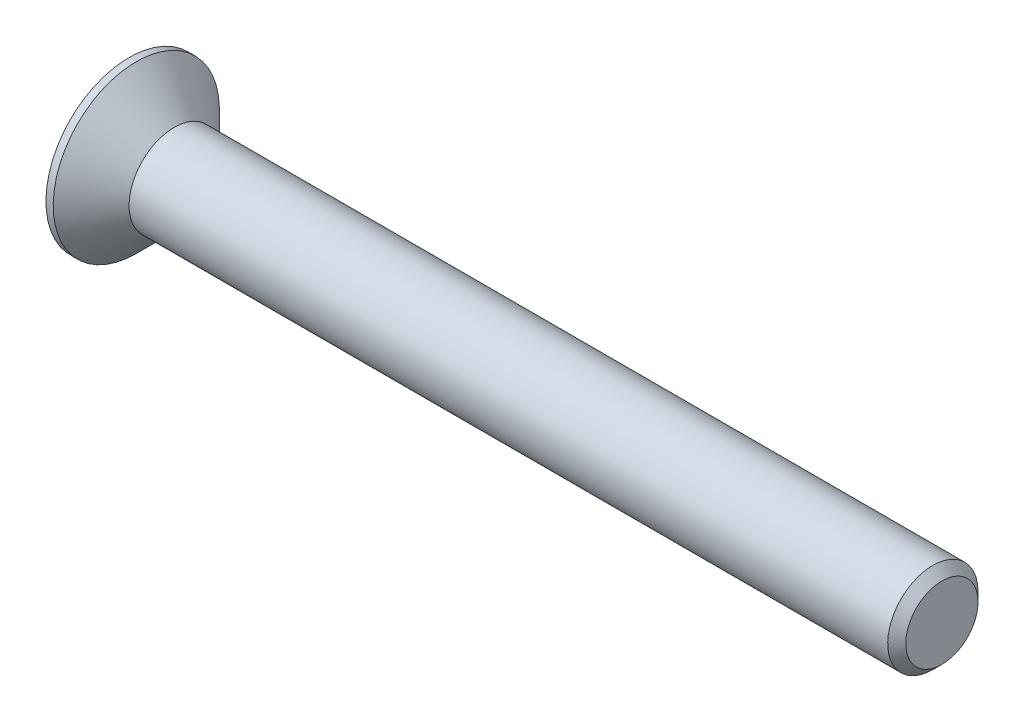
from build123d import *

# Parameters (mm, degrees)
CHAMFER1_SIZE      = 0.5
CUT_EXTRUDE1_DEPTH = 2.1


with BuildPart() as part:
    # Sketch1 → Revolve1 (revolve)
    with BuildSketch(Plane.XY, mode=Mode.PRIVATE) as revolve1_sk:
        Polygon((-2.5, 4.6), (-2.5, 0), (42.5, 0), (42.5, 2.5), (0, 2.5), (-2.1, 4.6), align=None)
    revolve(revolve1_sk.sketch.rotate(Axis((-2.5, 0, 0), (1, 0, 0)), 180), axis=Axis((-2.5, 0, 0), (1, 0, 0)))

    # Chamfer1
    chamfer1_edges = [part.edges().sort_by_distance(p)[0] for p in [
        (42.5, 2.5, 0),
    ]]
    chamfer(chamfer1_edges, length=CHAMFER1_SIZE)

    # Sketch2 → Cut-Extrude1 (cut)
    with BuildSketch(Plane.ZY.offset(2.5)):
        Polygon((-0.575, 2.3), (0.575, 2.3), (0.575, 0.575), (2.3, 0.575), (2.3, -0.575), (0.575, -0.575), (0.575, -2.3), (-0.575, -2.3), (-0.575, -0.575), (-2.3, -0.575), (-2.3, 0.575), (-0.575, 0.575), align=None)
    extrude(amount=-CUT_EXTRUDE1_DEPTH, mode=Mode.SUBTRACT)


solid = part.part
